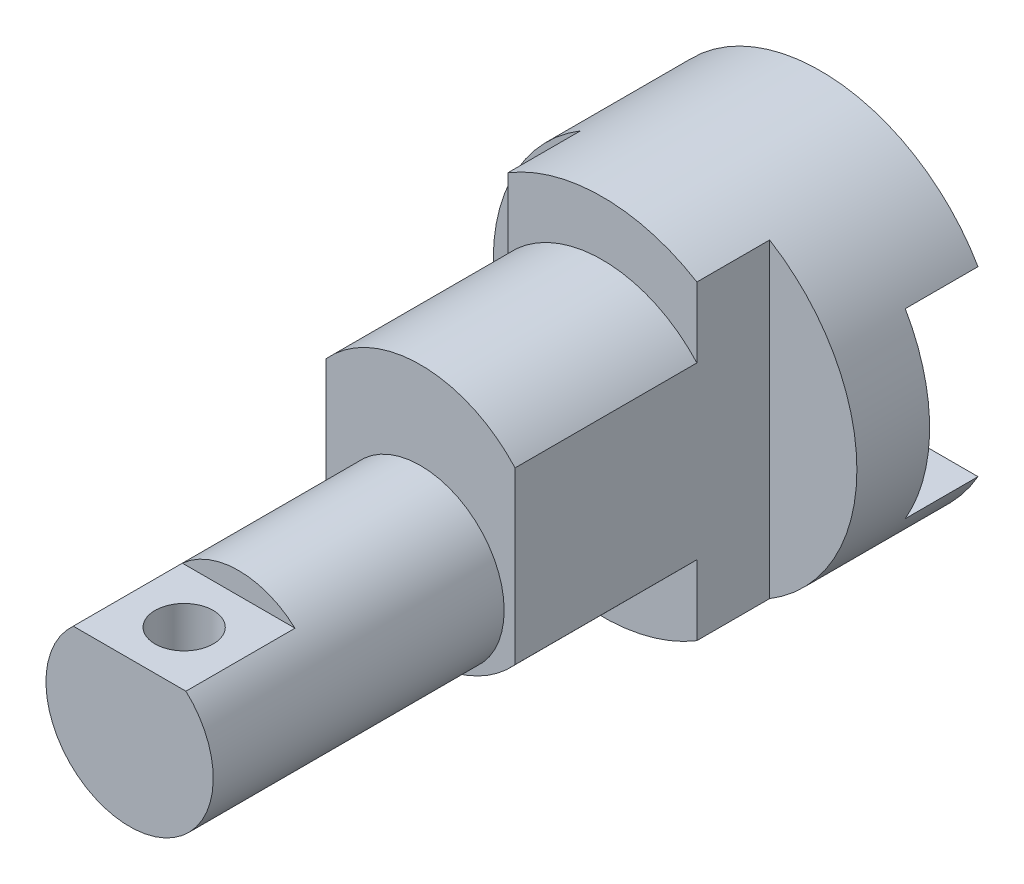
ISO-10303-21;
HEADER;
FILE_DESCRIPTION(('STEP AP214'),'2;1');
FILE_NAME('part.step','',(''),(''),'','','');
FILE_SCHEMA(('AUTOMOTIVE_DESIGN { 1 0 10303 214 1 1 1 1 }'));
ENDSEC;
DATA;
#1=APPLICATION_CONTEXT('core data for automotive mechanical design processes');
#2=APPLICATION_PROTOCOL_DEFINITION('international standard','automotive_design',2000,#1);
#3=PRODUCT_CONTEXT('',#1,'mechanical');
#4=PRODUCT('Part','Part','',(#3));
#5=PRODUCT_RELATED_PRODUCT_CATEGORY('part','',(#4));
#6=PRODUCT_DEFINITION_FORMATION('','',#4);
#7=PRODUCT_DEFINITION_CONTEXT('part definition',#1,'design');
#8=PRODUCT_DEFINITION('design','',#6,#7);
#9=PRODUCT_DEFINITION_SHAPE('','',#8);
#10=(LENGTH_UNIT() NAMED_UNIT(*) SI_UNIT(.MILLI.,.METRE.));
#11=(NAMED_UNIT(*) PLANE_ANGLE_UNIT() SI_UNIT($,.RADIAN.));
#12=(NAMED_UNIT(*) SI_UNIT($,.STERADIAN.) SOLID_ANGLE_UNIT());
#13=UNCERTAINTY_MEASURE_WITH_UNIT(LENGTH_MEASURE(1.E-05),#10,'distance_accuracy_value','');
#14=(GEOMETRIC_REPRESENTATION_CONTEXT(3) GLOBAL_UNCERTAINTY_ASSIGNED_CONTEXT((#13)) GLOBAL_UNIT_ASSIGNED_CONTEXT((#10,
#11,#12)) REPRESENTATION_CONTEXT('',''));
#15=CARTESIAN_POINT('',(0.,0.,0.));
#16=DIRECTION('',(0.,0.,1.));
#17=DIRECTION('',(1.,0.,0.));
#18=AXIS2_PLACEMENT_3D('',#15,#16,#17);
#19=CARTESIAN_POINT('',(0.,0.,0.));
#20=DIRECTION('',(0.,0.,1.));
#21=DIRECTION('',(1.,0.,0.));
#22=AXIS2_PLACEMENT_3D('',#19,#20,#21);
#23=PLANE('',#22);
#24=CARTESIAN_POINT('',(0.,0.,0.));
#25=DIRECTION('',(0.,0.,1.));
#26=DIRECTION('',(1.,0.,0.));
#27=AXIS2_PLACEMENT_3D('',#24,#25,#26);
#28=CIRCLE('',#27,50.);
#29=CARTESIAN_POINT('',(-43.3012701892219,-25.,0.));
#30=VERTEX_POINT('',#29);
#31=CARTESIAN_POINT('',(43.3012701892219,-25.,0.));
#32=VERTEX_POINT('',#31);
#33=EDGE_CURVE('E153',#30,#32,#28,.T.);
#34=ORIENTED_EDGE('',*,*,#33,.F.);
#35=DIRECTION('',(1.,0.,0.));
#36=VECTOR('',#35,1.);
#37=CARTESIAN_POINT('',(0.,-25.,0.));
#38=LINE('',#37,#36);
#39=EDGE_CURVE('E141',#30,#32,#38,.T.);
#40=ORIENTED_EDGE('',*,*,#39,.T.);
#41=EDGE_LOOP('',(#34,#40));
#42=FACE_BOUND('',#41,.T.);
#43=ADVANCED_FACE('F31',(#42),#23,.F.);
#44=CARTESIAN_POINT('',(0.,0.,60.));
#45=DIRECTION('',(0.,0.,1.));
#46=DIRECTION('',(1.,0.,0.));
#47=AXIS2_PLACEMENT_3D('',#44,#45,#46);
#48=PLANE('',#47);
#49=CARTESIAN_POINT('',(0.,0.,60.));
#50=DIRECTION('',(0.,0.,1.));
#51=DIRECTION('',(1.,0.,0.));
#52=AXIS2_PLACEMENT_3D('',#49,#50,#51);
#53=CIRCLE('',#52,50.);
#54=CARTESIAN_POINT('',(26.,42.7083130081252,60.));
#55=VERTEX_POINT('',#54);
#56=CARTESIAN_POINT('',(-26.,42.7083130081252,60.));
#57=VERTEX_POINT('',#56);
#58=EDGE_CURVE('E155',#55,#57,#53,.T.);
#59=ORIENTED_EDGE('',*,*,#58,.T.);
#60=DIRECTION('',(0.,-1.,0.));
#61=VECTOR('',#60,1.);
#62=CARTESIAN_POINT('',(-26.,0.,60.));
#63=LINE('',#62,#61);
#64=CARTESIAN_POINT('',(-26.,23.43074902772,60.));
#65=VERTEX_POINT('',#64);
#66=EDGE_CURVE('E203',#57,#65,#63,.T.);
#67=ORIENTED_EDGE('',*,*,#66,.T.);
#68=CARTESIAN_POINT('',(0.,0.,60.));
#69=DIRECTION('',(0.,0.,1.));
#70=DIRECTION('',(1.,0.,0.));
#71=AXIS2_PLACEMENT_3D('',#68,#69,#70);
#72=CIRCLE('',#71,35.);
#73=CARTESIAN_POINT('',(26.,23.43074902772,60.));
#74=VERTEX_POINT('',#73);
#75=EDGE_CURVE('E296',#74,#65,#72,.T.);
#76=ORIENTED_EDGE('',*,*,#75,.F.);
#77=DIRECTION('',(0.,1.,0.));
#78=VECTOR('',#77,1.);
#79=CARTESIAN_POINT('',(26.,0.,60.));
#80=LINE('',#79,#78);
#81=EDGE_CURVE('E220',#74,#55,#80,.T.);
#82=ORIENTED_EDGE('',*,*,#81,.T.);
#83=EDGE_LOOP('',(#59,#67,#76,#82));
#84=FACE_BOUND('',#83,.T.);
#85=ADVANCED_FACE('F264',(#84),#48,.T.);
#86=CARTESIAN_POINT('',(-26.,-23.43074902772,60.));
#87=VERTEX_POINT('',#86);
#88=CARTESIAN_POINT('',(26.,-23.43074902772,60.));
#89=VERTEX_POINT('',#88);
#90=EDGE_CURVE('E305',#87,#89,#72,.T.);
#91=ORIENTED_EDGE('',*,*,#90,.F.);
#92=CARTESIAN_POINT('',(-26.,-42.7083130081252,60.));
#93=VERTEX_POINT('',#92);
#94=EDGE_CURVE('E200',#87,#93,#63,.T.);
#95=ORIENTED_EDGE('',*,*,#94,.T.);
#96=CARTESIAN_POINT('',(26.,-42.7083130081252,60.));
#97=VERTEX_POINT('',#96);
#98=EDGE_CURVE('E152',#93,#97,#53,.T.);
#99=ORIENTED_EDGE('',*,*,#98,.T.);
#100=EDGE_CURVE('E223',#97,#89,#80,.T.);
#101=ORIENTED_EDGE('',*,*,#100,.T.);
#102=EDGE_LOOP('',(#91,#95,#99,#101));
#103=FACE_BOUND('',#102,.T.);
#104=ADVANCED_FACE('F268',(#103),#48,.T.);
#105=CARTESIAN_POINT('',(0.,0.,60.));
#106=DIRECTION('',(0.,0.,-1.));
#107=DIRECTION('',(-1.,0.,0.));
#108=AXIS2_PLACEMENT_3D('',#105,#106,#107);
#109=CYLINDRICAL_SURFACE('',#108,50.);
#110=ORIENTED_EDGE('',*,*,#33,.T.);
#111=DIRECTION('',(0.,0.,-1.));
#112=VECTOR('',#111,1.);
#113=CARTESIAN_POINT('',(43.3012701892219,-25.,60.));
#114=LINE('',#113,#112);
#115=CARTESIAN_POINT('',(43.3012701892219,-25.,20.));
#116=VERTEX_POINT('',#115);
#117=EDGE_CURVE('E149',#32,#116,#114,.F.);
#118=ORIENTED_EDGE('',*,*,#117,.T.);
#119=CARTESIAN_POINT('',(0.,0.,20.));
#120=DIRECTION('',(0.,0.,1.));
#121=DIRECTION('',(0.,-1.,0.));
#122=AXIS2_PLACEMENT_3D('',#119,#120,#121);
#123=CIRCLE('',#122,50.);
#124=CARTESIAN_POINT('',(43.3012701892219,25.,20.));
#125=VERTEX_POINT('',#124);
#126=EDGE_CURVE('E11',#116,#125,#123,.T.);
#127=ORIENTED_EDGE('',*,*,#126,.T.);
#128=DIRECTION('',(0.,0.,-1.));
#129=VECTOR('',#128,1.);
#130=CARTESIAN_POINT('',(43.3012701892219,25.,60.));
#131=LINE('',#130,#129);
#132=CARTESIAN_POINT('',(43.3012701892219,25.,0.));
#133=VERTEX_POINT('',#132);
#134=EDGE_CURVE('E136',#125,#133,#131,.T.);
#135=ORIENTED_EDGE('',*,*,#134,.T.);
#136=CARTESIAN_POINT('',(-43.3012701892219,25.,0.));
#137=VERTEX_POINT('',#136);
#138=EDGE_CURVE('E147',#133,#137,#28,.T.);
#139=ORIENTED_EDGE('',*,*,#138,.T.);
#140=DIRECTION('',(0.,0.,-1.));
#141=VECTOR('',#140,1.);
#142=CARTESIAN_POINT('',(-43.3012701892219,25.,60.));
#143=LINE('',#142,#141);
#144=CARTESIAN_POINT('',(-43.3012701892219,25.,20.));
#145=VERTEX_POINT('',#144);
#146=EDGE_CURVE('E46',#137,#145,#143,.F.);
#147=ORIENTED_EDGE('',*,*,#146,.T.);
#148=CARTESIAN_POINT('',(-43.3012701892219,-25.,20.));
#149=VERTEX_POINT('',#148);
#150=EDGE_CURVE('E35',#145,#149,#123,.T.);
#151=ORIENTED_EDGE('',*,*,#150,.T.);
#152=DIRECTION('',(0.,0.,-1.));
#153=VECTOR('',#152,1.);
#154=CARTESIAN_POINT('',(-43.3012701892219,-25.,60.));
#155=LINE('',#154,#153);
#156=EDGE_CURVE('E173',#149,#30,#155,.T.);
#157=ORIENTED_EDGE('',*,*,#156,.T.);
#158=EDGE_LOOP('',(#110,#118,#127,#135,#139,#147,#151,#157));
#159=FACE_BOUND('',#158,.T.);
#160=DIRECTION('',(0.,0.,-1.));
#161=VECTOR('',#160,1.);
#162=CARTESIAN_POINT('',(-26.,42.7083130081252,190.));
#163=LINE('',#162,#161);
#164=CARTESIAN_POINT('',(-26.,42.7083130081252,40.));
#165=VERTEX_POINT('',#164);
#166=EDGE_CURVE('E192',#57,#165,#163,.T.);
#167=ORIENTED_EDGE('',*,*,#166,.F.);
#168=ORIENTED_EDGE('',*,*,#58,.F.);
#169=DIRECTION('',(0.,0.,-1.));
#170=VECTOR('',#169,1.);
#171=CARTESIAN_POINT('',(26.,42.7083130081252,190.));
#172=LINE('',#171,#170);
#173=CARTESIAN_POINT('',(26.,42.7083130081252,40.));
#174=VERTEX_POINT('',#173);
#175=EDGE_CURVE('E212',#55,#174,#172,.T.);
#176=ORIENTED_EDGE('',*,*,#175,.T.);
#177=CARTESIAN_POINT('',(0.,0.,40.));
#178=DIRECTION('',(0.,0.,1.));
#179=DIRECTION('',(1.,0.,0.));
#180=AXIS2_PLACEMENT_3D('',#177,#178,#179);
#181=CIRCLE('',#180,50.);
#182=CARTESIAN_POINT('',(26.,-42.7083130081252,40.));
#183=VERTEX_POINT('',#182);
#184=EDGE_CURVE('E204',#183,#174,#181,.T.);
#185=ORIENTED_EDGE('',*,*,#184,.F.);
#186=DIRECTION('',(0.,0.,-1.));
#187=VECTOR('',#186,1.);
#188=CARTESIAN_POINT('',(26.,-42.7083130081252,190.));
#189=LINE('',#188,#187);
#190=EDGE_CURVE('E210',#97,#183,#189,.T.);
#191=ORIENTED_EDGE('',*,*,#190,.F.);
#192=ORIENTED_EDGE('',*,*,#98,.F.);
#193=DIRECTION('',(0.,0.,-1.));
#194=VECTOR('',#193,1.);
#195=CARTESIAN_POINT('',(-26.,-42.7083130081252,190.));
#196=LINE('',#195,#194);
#197=CARTESIAN_POINT('',(-26.,-42.7083130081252,40.));
#198=VERTEX_POINT('',#197);
#199=EDGE_CURVE('E194',#93,#198,#196,.T.);
#200=ORIENTED_EDGE('',*,*,#199,.T.);
#201=CARTESIAN_POINT('',(0.,0.,40.));
#202=DIRECTION('',(0.,0.,1.));
#203=DIRECTION('',(1.,0.,0.));
#204=AXIS2_PLACEMENT_3D('',#201,#202,#203);
#205=CIRCLE('',#204,50.);
#206=EDGE_CURVE('E186',#165,#198,#205,.T.);
#207=ORIENTED_EDGE('',*,*,#206,.F.);
#208=EDGE_LOOP('',(#167,#168,#176,#185,#191,#192,#200,#207));
#209=FACE_BOUND('',#208,.T.);
#210=ADVANCED_FACE('F33',(#159,#209),#109,.T.);
#211=CARTESIAN_POINT('',(0.,0.,110.));
#212=DIRECTION('',(0.,0.,-1.));
#213=DIRECTION('',(-1.,0.,0.));
#214=AXIS2_PLACEMENT_3D('',#211,#212,#213);
#215=CYLINDRICAL_SURFACE('',#214,35.);
#216=DIRECTION('',(0.,0.,-1.));
#217=VECTOR('',#216,1.);
#218=CARTESIAN_POINT('',(-26.,23.43074902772,110.));
#219=LINE('',#218,#217);
#220=CARTESIAN_POINT('',(-26.,23.43074902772,110.));
#221=VERTEX_POINT('',#220);
#222=EDGE_CURVE('E198',#221,#65,#219,.T.);
#223=ORIENTED_EDGE('',*,*,#222,.F.);
#224=CARTESIAN_POINT('',(0.,0.,110.));
#225=DIRECTION('',(0.,0.,1.));
#226=DIRECTION('',(1.,0.,0.));
#227=AXIS2_PLACEMENT_3D('',#224,#225,#226);
#228=CIRCLE('',#227,35.);
#229=CARTESIAN_POINT('',(26.,23.43074902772,110.));
#230=VERTEX_POINT('',#229);
#231=EDGE_CURVE('E294',#230,#221,#228,.T.);
#232=ORIENTED_EDGE('',*,*,#231,.F.);
#233=DIRECTION('',(0.,0.,-1.));
#234=VECTOR('',#233,1.);
#235=CARTESIAN_POINT('',(26.,23.43074902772,110.));
#236=LINE('',#235,#234);
#237=EDGE_CURVE('E215',#74,#230,#236,.F.);
#238=ORIENTED_EDGE('',*,*,#237,.F.);
#239=ORIENTED_EDGE('',*,*,#75,.T.);
#240=EDGE_LOOP('',(#223,#232,#238,#239));
#241=FACE_BOUND('',#240,.T.);
#242=ADVANCED_FACE('F281',(#241),#215,.T.);
#243=DIRECTION('',(0.,0.,-1.));
#244=VECTOR('',#243,1.);
#245=CARTESIAN_POINT('',(-26.,-23.43074902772,110.));
#246=LINE('',#245,#244);
#247=CARTESIAN_POINT('',(-26.,-23.43074902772,110.));
#248=VERTEX_POINT('',#247);
#249=EDGE_CURVE('E54',#87,#248,#246,.F.);
#250=ORIENTED_EDGE('',*,*,#249,.F.);
#251=ORIENTED_EDGE('',*,*,#90,.T.);
#252=DIRECTION('',(0.,0.,-1.));
#253=VECTOR('',#252,1.);
#254=CARTESIAN_POINT('',(26.,-23.43074902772,110.));
#255=LINE('',#254,#253);
#256=CARTESIAN_POINT('',(26.,-23.43074902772,110.));
#257=VERTEX_POINT('',#256);
#258=EDGE_CURVE('E217',#257,#89,#255,.T.);
#259=ORIENTED_EDGE('',*,*,#258,.F.);
#260=CARTESIAN_POINT('',(0.,-35.,110.));
#261=VERTEX_POINT('',#260);
#262=EDGE_CURVE('E157',#261,#257,#228,.T.);
#263=ORIENTED_EDGE('',*,*,#262,.F.);
#264=EDGE_CURVE('E300',#248,#261,#228,.T.);
#265=ORIENTED_EDGE('',*,*,#264,.F.);
#266=EDGE_LOOP('',(#250,#251,#259,#263,#265));
#267=FACE_BOUND('',#266,.T.);
#268=ADVANCED_FACE('F276',(#267),#215,.T.);
#269=CARTESIAN_POINT('',(0.,0.,110.));
#270=DIRECTION('',(0.,0.,1.));
#271=DIRECTION('',(1.,0.,0.));
#272=AXIS2_PLACEMENT_3D('',#269,#270,#271);
#273=PLANE('',#272);
#274=ORIENTED_EDGE('',*,*,#231,.T.);
#275=DIRECTION('',(0.,-1.,0.));
#276=VECTOR('',#275,1.);
#277=CARTESIAN_POINT('',(-26.,0.,110.));
#278=LINE('',#277,#276);
#279=EDGE_CURVE('E142',#221,#248,#278,.T.);
#280=ORIENTED_EDGE('',*,*,#279,.T.);
#281=ORIENTED_EDGE('',*,*,#264,.T.);
#282=CARTESIAN_POINT('',(0.,-12.,110.));
#283=DIRECTION('',(0.,0.,1.));
#284=DIRECTION('',(1.,0.,0.));
#285=AXIS2_PLACEMENT_3D('',#282,#283,#284);
#286=CIRCLE('',#285,23.);
#287=EDGE_CURVE('E303',#261,#261,#286,.T.);
#288=ORIENTED_EDGE('',*,*,#287,.F.);
#289=ORIENTED_EDGE('',*,*,#262,.T.);
#290=DIRECTION('',(0.,1.,0.));
#291=VECTOR('',#290,1.);
#292=CARTESIAN_POINT('',(26.,0.,110.));
#293=LINE('',#292,#291);
#294=EDGE_CURVE('E165',#257,#230,#293,.T.);
#295=ORIENTED_EDGE('',*,*,#294,.T.);
#296=EDGE_LOOP('',(#274,#280,#281,#288,#289,#295));
#297=FACE_BOUND('',#296,.T.);
#298=ADVANCED_FACE('F272',(#297),#273,.T.);
#299=ORIENTED_EDGE('',*,*,#138,.F.);
#300=DIRECTION('',(-1.,0.,0.));
#301=VECTOR('',#300,1.);
#302=CARTESIAN_POINT('',(0.,25.,0.));
#303=LINE('',#302,#301);
#304=EDGE_CURVE('E133',#133,#137,#303,.T.);
#305=ORIENTED_EDGE('',*,*,#304,.T.);
#306=EDGE_LOOP('',(#299,#305));
#307=FACE_BOUND('',#306,.T.);
#308=ADVANCED_FACE('F151',(#307),#23,.F.);
#309=CARTESIAN_POINT('',(0.,-12.,190.));
#310=DIRECTION('',(0.,0.,-1.));
#311=DIRECTION('',(-1.,0.,0.));
#312=AXIS2_PLACEMENT_3D('',#309,#310,#311);
#313=CYLINDRICAL_SURFACE('',#312,23.);
#314=CARTESIAN_POINT('',(0.,-35.,183.));
#315=CARTESIAN_POINT('',(0.217698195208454,-35.0000002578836,183.000000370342));
#316=CARTESIAN_POINT('',(0.435390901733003,-34.9969022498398,182.991106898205));
#317=CARTESIAN_POINT('',(0.86915745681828,-34.9845956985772,182.955621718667));
#318=CARTESIAN_POINT('',(1.08523129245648,-34.9753871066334,182.929029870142));
#319=CARTESIAN_POINT('',(1.51416564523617,-34.9511099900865,182.858406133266));
#320=CARTESIAN_POINT('',(1.72702623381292,-34.9360415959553,182.814374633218));
#321=CARTESIAN_POINT('',(2.14803250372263,-34.9004495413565,182.709282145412));
#322=CARTESIAN_POINT('',(2.35617812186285,-34.8799258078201,182.648220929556));
#323=CARTESIAN_POINT('',(2.76593194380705,-34.8340106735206,182.509746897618));
#324=CARTESIAN_POINT('',(2.96755229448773,-34.8086290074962,182.432366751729));
#325=CARTESIAN_POINT('',(3.36346343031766,-34.7536167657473,182.261789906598));
#326=CARTESIAN_POINT('',(3.55775164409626,-34.7239847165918,182.168587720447));
#327=CARTESIAN_POINT('',(3.93771098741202,-34.6612335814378,181.967113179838));
#328=CARTESIAN_POINT('',(4.12338360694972,-34.6281151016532,181.858843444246));
#329=CARTESIAN_POINT('',(4.48513691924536,-34.5591992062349,181.627941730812));
#330=CARTESIAN_POINT('',(4.66121412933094,-34.5234008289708,181.505304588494));
#331=CARTESIAN_POINT('',(5.00844074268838,-34.4487884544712,181.242158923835));
#332=CARTESIAN_POINT('',(5.17922802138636,-34.4099136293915,181.101189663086));
#333=CARTESIAN_POINT('',(5.50842805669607,-34.3312755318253,180.805699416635));
#334=CARTESIAN_POINT('',(5.66684050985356,-34.2915122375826,180.651178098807));
#335=CARTESIAN_POINT('',(5.97040912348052,-34.2121327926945,180.32946036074));
#336=CARTESIAN_POINT('',(6.11555984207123,-34.1725167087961,180.162258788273));
#337=CARTESIAN_POINT('',(6.39158536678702,-34.0945288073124,179.816284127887));
#338=CARTESIAN_POINT('',(6.52246502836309,-34.0561565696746,179.637515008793));
#339=CARTESIAN_POINT('',(6.77312918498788,-33.9805007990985,179.26345265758));
#340=CARTESIAN_POINT('',(6.89241910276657,-33.9432924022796,179.067812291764));
#341=CARTESIAN_POINT('',(7.1139711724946,-33.8724699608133,178.666593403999));
#342=CARTESIAN_POINT('',(7.21624008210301,-33.8388544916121,178.461018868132));
#343=CARTESIAN_POINT('',(7.40294407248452,-33.776274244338,178.041246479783));
#344=CARTESIAN_POINT('',(7.48738005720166,-33.7473092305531,177.827049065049));
#345=CARTESIAN_POINT('',(7.63763783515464,-33.6949954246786,177.3915555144));
#346=CARTESIAN_POINT('',(7.70346054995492,-33.6716463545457,177.170259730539));
#347=CARTESIAN_POINT('',(7.81379278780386,-33.632104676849,176.73037082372));
#348=CARTESIAN_POINT('',(7.85898802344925,-33.6156834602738,176.511970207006));
#349=CARTESIAN_POINT('',(7.93101771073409,-33.5893592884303,176.071771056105));
#350=CARTESIAN_POINT('',(7.95785257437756,-33.5794561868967,175.849972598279));
#351=CARTESIAN_POINT('',(7.99287190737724,-33.5665098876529,175.404773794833));
#352=CARTESIAN_POINT('',(8.00106188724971,-33.5634646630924,175.181373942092));
#353=CARTESIAN_POINT('',(7.99871794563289,-33.5643343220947,174.73468977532));
#354=CARTESIAN_POINT('',(7.98818461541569,-33.568248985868,174.511405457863));
#355=CARTESIAN_POINT('',(7.94951648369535,-33.5825295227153,174.077988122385));
#356=CARTESIAN_POINT('',(7.92229929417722,-33.5925589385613,173.867761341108));
#357=CARTESIAN_POINT('',(7.8513423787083,-33.6184608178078,173.450405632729));
#358=CARTESIAN_POINT('',(7.80759684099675,-33.6343353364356,173.243277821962));
#359=CARTESIAN_POINT('',(7.70399611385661,-33.6714435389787,172.833651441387));
#360=CARTESIAN_POINT('',(7.64414546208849,-33.692675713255,172.631151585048));
#361=CARTESIAN_POINT('',(7.50881216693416,-33.7398912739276,172.231935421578));
#362=CARTESIAN_POINT('',(7.43332357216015,-33.7658764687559,172.035221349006));
#363=CARTESIAN_POINT('',(7.26592988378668,-33.8223323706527,171.64560463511));
#364=CARTESIAN_POINT('',(7.17377130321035,-33.852870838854,171.452820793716));
#365=CARTESIAN_POINT('',(6.97456977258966,-33.9172610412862,171.075603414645));
#366=CARTESIAN_POINT('',(6.86752174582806,-33.9511139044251,170.891172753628));
#367=CARTESIAN_POINT('',(6.63927955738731,-34.0212219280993,170.531746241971));
#368=CARTESIAN_POINT('',(6.5180842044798,-34.0574772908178,170.356751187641));
#369=CARTESIAN_POINT('',(6.26230747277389,-34.1314533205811,170.01715985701));
#370=CARTESIAN_POINT('',(6.12772557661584,-34.1691740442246,169.852563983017));
#371=CARTESIAN_POINT('',(5.8378650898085,-34.2473173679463,169.52553466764));
#372=CARTESIAN_POINT('',(5.68184189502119,-34.2877707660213,169.363767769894));
#373=CARTESIAN_POINT('',(5.35672473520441,-34.3681364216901,169.053916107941));
#374=CARTESIAN_POINT('',(5.18763485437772,-34.4080488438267,168.905827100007));
#375=CARTESIAN_POINT('',(4.83727787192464,-34.4862840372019,168.624163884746));
#376=CARTESIAN_POINT('',(4.65600480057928,-34.5246060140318,168.490596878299));
#377=CARTESIAN_POINT('',(4.28254040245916,-34.5985854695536,168.239044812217));
#378=CARTESIAN_POINT('',(4.09035345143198,-34.6342440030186,168.121053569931));
#379=CARTESIAN_POINT('',(3.69381401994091,-34.7023498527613,167.900150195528));
#380=CARTESIAN_POINT('',(3.48934229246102,-34.7347529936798,167.797438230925));
#381=CARTESIAN_POINT('',(3.07185991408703,-34.7949145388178,167.609733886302));
#382=CARTESIAN_POINT('',(2.85885285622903,-34.8226748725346,167.524734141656));
#383=CARTESIAN_POINT('',(2.42576745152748,-34.8727602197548,167.373186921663));
#384=CARTESIAN_POINT('',(2.20568976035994,-34.8950857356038,167.306637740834));
#385=CARTESIAN_POINT('',(1.76012060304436,-34.9336426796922,167.192641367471));
#386=CARTESIAN_POINT('',(1.53462941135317,-34.9498744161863,167.1451932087));
#387=CARTESIAN_POINT('',(1.09065621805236,-34.9751513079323,167.071651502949));
#388=CARTESIAN_POINT('',(0.872339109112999,-34.9844968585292,167.044663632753));
#389=CARTESIAN_POINT('',(0.434048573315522,-34.9969488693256,167.008758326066));
#390=CARTESIAN_POINT('',(0.214075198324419,-35.0000555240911,166.999840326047));
#391=CARTESIAN_POINT('',(-0.225818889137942,-34.9999429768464,167.000163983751));
#392=CARTESIAN_POINT('',(-0.445739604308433,-34.996724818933,167.009402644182));
#393=CARTESIAN_POINT('',(-0.88389184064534,-34.984054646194,167.045940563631));
#394=CARTESIAN_POINT('',(-1.10212338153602,-34.9746027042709,167.073239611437));
#395=CARTESIAN_POINT('',(-1.52826007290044,-34.9501306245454,167.144455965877));
#396=CARTESIAN_POINT('',(-1.73627102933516,-34.9353002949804,167.187807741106));
#397=CARTESIAN_POINT('',(-2.14784935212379,-34.9004238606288,167.29080028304));
#398=CARTESIAN_POINT('',(-2.35141511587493,-34.8803759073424,167.350446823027));
#399=CARTESIAN_POINT('',(-2.7526473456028,-34.8355791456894,167.485498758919));
#400=CARTESIAN_POINT('',(-2.95031544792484,-34.8108316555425,167.560899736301));
#401=CARTESIAN_POINT('',(-3.33866711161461,-34.7572349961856,167.726904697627));
#402=CARTESIAN_POINT('',(-3.52934799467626,-34.7283842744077,167.817514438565));
#403=CARTESIAN_POINT('',(-3.90759978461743,-34.6664594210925,168.015910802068));
#404=CARTESIAN_POINT('',(-4.09494590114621,-34.6332919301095,168.124096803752));
#405=CARTESIAN_POINT('',(-4.45997092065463,-34.5642013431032,168.355052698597));
#406=CARTESIAN_POINT('',(-4.63764646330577,-34.5282772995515,168.477827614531));
#407=CARTESIAN_POINT('',(-4.98227552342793,-34.4545761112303,168.737138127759));
#408=CARTESIAN_POINT('',(-5.14922780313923,-34.4167987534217,168.87367530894));
#409=CARTESIAN_POINT('',(-5.47145884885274,-34.34033492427,169.15966203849));
#410=CARTESIAN_POINT('',(-5.62673726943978,-34.3016484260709,169.30911196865));
#411=CARTESIAN_POINT('',(-5.93218856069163,-34.2224045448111,169.627825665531));
#412=CARTESIAN_POINT('',(-6.08171950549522,-34.181850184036,169.797706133));
#413=CARTESIAN_POINT('',(-6.36593382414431,-34.1019609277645,170.149636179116));
#414=CARTESIAN_POINT('',(-6.50062205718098,-34.0626256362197,170.331681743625));
#415=CARTESIAN_POINT('',(-6.75434313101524,-33.9862778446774,170.706962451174));
#416=CARTESIAN_POINT('',(-6.87336901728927,-33.9492663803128,170.900202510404));
#417=CARTESIAN_POINT('',(-7.09475961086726,-33.878708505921,171.296504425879));
#418=CARTESIAN_POINT('',(-7.19713128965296,-33.8451606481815,171.499562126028));
#419=CARTESIAN_POINT('',(-7.38445275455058,-33.7825530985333,171.91428522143));
#420=CARTESIAN_POINT('',(-7.46939909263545,-33.7534942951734,172.12595231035));
#421=CARTESIAN_POINT('',(-7.62104488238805,-33.7008323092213,172.556294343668));
#422=CARTESIAN_POINT('',(-7.68775180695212,-33.6772268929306,172.774966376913));
#423=CARTESIAN_POINT('',(-7.80229339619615,-33.6362640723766,173.217727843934));
#424=CARTESIAN_POINT('',(-7.85013212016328,-33.6189053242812,173.441816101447));
#425=CARTESIAN_POINT('',(-7.92644665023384,-33.5910421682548,173.893683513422));
#426=CARTESIAN_POINT('',(-7.95492355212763,-33.5805373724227,174.12146245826));
#427=CARTESIAN_POINT('',(-7.99115967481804,-33.5671442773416,174.566061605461));
#428=CARTESIAN_POINT('',(-7.9999868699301,-33.563863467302,174.782783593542));
#429=CARTESIAN_POINT('',(-8.00001309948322,-33.5638538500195,175.216226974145));
#430=CARTESIAN_POINT('',(-7.99121257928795,-33.5671248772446,175.432948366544));
#431=CARTESIAN_POINT('',(-7.95607500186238,-33.5801116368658,175.864749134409));
#432=CARTESIAN_POINT('',(-7.92973931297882,-33.5898268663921,176.079828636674));
#433=CARTESIAN_POINT('',(-7.85979573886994,-33.6153878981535,176.506787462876));
#434=CARTESIAN_POINT('',(-7.81618781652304,-33.6312337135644,176.718666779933));
#435=CARTESIAN_POINT('',(-7.71330254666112,-33.6681303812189,177.132950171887));
#436=CARTESIAN_POINT('',(-7.65440503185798,-33.6890543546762,177.335460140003));
#437=CARTESIAN_POINT('',(-7.52099476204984,-33.735676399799,177.734770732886));
#438=CARTESIAN_POINT('',(-7.44647681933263,-33.761376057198,177.931569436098));
#439=CARTESIAN_POINT('',(-7.28242755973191,-33.816822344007,178.318180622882));
#440=CARTESIAN_POINT('',(-7.19289886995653,-33.8465682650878,178.507994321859));
#441=CARTESIAN_POINT('',(-6.99946285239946,-33.9093098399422,178.879621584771));
#442=CARTESIAN_POINT('',(-6.89554996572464,-33.9423067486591,179.061432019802));
#443=CARTESIAN_POINT('',(-6.55296253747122,-34.0480736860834,179.609750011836));
#444=CARTESIAN_POINT('',(-6.29099070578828,-34.1249458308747,179.961259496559));
#445=CARTESIAN_POINT('',(-5.7135032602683,-34.2810461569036,180.616647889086));
#446=CARTESIAN_POINT('',(-5.39797187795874,-34.3602750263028,180.920512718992));
#447=CARTESIAN_POINT('',(-4.88291098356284,-34.4764355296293,181.341084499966));
#448=CARTESIAN_POINT('',(-4.69993365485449,-34.515499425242,181.477876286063));
#449=CARTESIAN_POINT('',(-4.32260206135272,-34.5909729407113,181.735520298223));
#450=CARTESIAN_POINT('',(-4.12825214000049,-34.6273835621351,181.85637855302));
#451=CARTESIAN_POINT('',(-3.72935374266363,-34.6965398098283,182.081269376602));
#452=CARTESIAN_POINT('',(-3.52480211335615,-34.729284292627,182.18529670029));
#453=CARTESIAN_POINT('',(-3.10702550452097,-34.7901496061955,182.375570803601));
#454=CARTESIAN_POINT('',(-2.8938043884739,-34.8182724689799,182.461825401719));
#455=CARTESIAN_POINT('',(-2.46342392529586,-34.8687072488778,182.61465020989));
#456=CARTESIAN_POINT('',(-2.24637285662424,-34.8911005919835,182.681498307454));
#457=CARTESIAN_POINT('',(-1.80686859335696,-34.9299778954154,182.796590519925));
#458=CARTESIAN_POINT('',(-1.5844154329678,-34.9464618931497,182.844834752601));
#459=CARTESIAN_POINT('',(-1.13589564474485,-34.9730318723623,182.92221657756));
#460=CARTESIAN_POINT('',(-0.909830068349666,-34.9831196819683,182.951359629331));
#461=CARTESIAN_POINT('',(-0.455840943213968,-34.9966034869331,182.990250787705));
#462=CARTESIAN_POINT('',(-0.22791746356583,-34.9999997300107,182.999999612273));
#463=CARTESIAN_POINT('',(0.,-35.,183.));
#464=B_SPLINE_CURVE_WITH_KNOTS('',3,(#314,#315,#316,#317,#318,#319,#320,#321,#322,#323,#324,
#325,#326,#327,#328,#329,#330,#331,#332,#333,#334,#335,#336,#337,#338,#339,#340,#341,#342,#343,
#344,#345,#346,#347,#348,#349,#350,#351,#352,#353,#354,#355,#356,#357,#358,#359,#360,#361,#362,
#363,#364,#365,#366,#367,#368,#369,#370,#371,#372,#373,#374,#375,#376,#377,#378,#379,#380,#381,
#382,#383,#384,#385,#386,#387,#388,#389,#390,#391,#392,#393,#394,#395,#396,#397,#398,#399,#400,
#401,#402,#403,#404,#405,#406,#407,#408,#409,#410,#411,#412,#413,#414,#415,#416,#417,#418,#419,
#420,#421,#422,#423,#424,#425,#426,#427,#428,#429,#430,#431,#432,#433,#434,#435,#436,#437,#438,
#439,#440,#441,#442,#443,#444,#445,#446,#447,#448,#449,#450,#451,#452,#453,#454,#455,#456,#457,
#458,#459,#460,#461,#462,#463),.UNSPECIFIED.,.T.,.F.,(4,2,2,2,2,2,2,2,2,2,2,2,2,2,2,2,2,2,2,2,2,
2,2,2,2,2,2,2,2,2,2,2,2,2,2,2,2,2,2,2,2,2,2,2,2,2,2,2,2,2,2,2,2,2,2,2,2,2,2,2,2,2,2,2,2,2,2,2,2,
2,2,2,2,2,4),(0.,0.652882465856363,1.30577013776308,1.95864327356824,2.61152515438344,
3.26311217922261,3.91492563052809,4.56662593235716,5.21856121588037,5.89231451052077,
6.56608432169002,7.24012938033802,7.91394438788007,8.60951182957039,9.30480245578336,
10.0000578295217,10.6952787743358,11.3653145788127,12.0353353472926,12.7051580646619,
13.3749596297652,14.0108689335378,14.647002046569,15.2829561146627,15.9191526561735,
16.5659912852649,17.2130510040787,17.8601652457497,18.5073045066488,19.1915931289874,
19.8756687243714,20.5600819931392,21.2442227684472,21.9366582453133,22.6288052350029,
23.3208882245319,24.0129362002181,24.6726433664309,25.3323299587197,25.9919076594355,
26.6514776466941,27.2897334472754,27.9282156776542,28.5665190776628,29.2050646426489,
29.8609372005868,30.5170362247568,31.1732108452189,31.8294048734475,32.5183593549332,
33.2070876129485,33.8961206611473,34.5848645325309,35.2737445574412,35.9623419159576,
36.6507910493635,37.3392012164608,37.9891747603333,38.6391318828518,39.2890382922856,
39.9389460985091,40.5740396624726,41.2093444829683,41.8445382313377,42.4799781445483,
43.8089739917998,45.1383617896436,45.8329672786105,46.5273091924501,47.221867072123,
47.9161187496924,48.5998742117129,49.2836253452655,49.9671809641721,50.6507112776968),.UNSPECIFIED.);
#465=CARTESIAN_POINT('',(0.,-35.,183.));
#466=VERTEX_POINT('',#465);
#467=EDGE_CURVE('E227',#466,#466,#464,.T.);
#468=ORIENTED_EDGE('',*,*,#467,.T.);
#469=EDGE_LOOP('',(#468));
#470=FACE_BOUND('',#469,.T.);
#471=CARTESIAN_POINT('',(0.,-12.,190.));
#472=DIRECTION('',(0.,0.,1.));
#473=DIRECTION('',(1.,0.,0.));
#474=AXIS2_PLACEMENT_3D('',#471,#472,#473);
#475=CIRCLE('',#474,23.);
#476=CARTESIAN_POINT('',(-15.4919333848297,5.,190.));
#477=VERTEX_POINT('',#476);
#478=CARTESIAN_POINT('',(15.4919333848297,5.,190.));
#479=VERTEX_POINT('',#478);
#480=EDGE_CURVE('E306',#477,#479,#475,.T.);
#481=ORIENTED_EDGE('',*,*,#480,.F.);
#482=DIRECTION('',(0.,0.,-1.));
#483=VECTOR('',#482,1.);
#484=CARTESIAN_POINT('',(-15.4919333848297,5.,190.));
#485=LINE('',#484,#483);
#486=CARTESIAN_POINT('',(-15.4919333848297,5.,160.));
#487=VERTEX_POINT('',#486);
#488=EDGE_CURVE('E312',#477,#487,#485,.T.);
#489=ORIENTED_EDGE('',*,*,#488,.T.);
#490=CARTESIAN_POINT('',(0.,-12.,160.));
#491=DIRECTION('',(0.,0.,-1.));
#492=DIRECTION('',(-1.,0.,0.));
#493=AXIS2_PLACEMENT_3D('',#490,#491,#492);
#494=CIRCLE('',#493,23.);
#495=CARTESIAN_POINT('',(15.4919333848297,5.,160.));
#496=VERTEX_POINT('',#495);
#497=EDGE_CURVE('E162',#487,#496,#494,.T.);
#498=ORIENTED_EDGE('',*,*,#497,.T.);
#499=DIRECTION('',(0.,0.,-1.));
#500=VECTOR('',#499,1.);
#501=CARTESIAN_POINT('',(15.4919333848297,5.,190.));
#502=LINE('',#501,#500);
#503=EDGE_CURVE('E315',#496,#479,#502,.F.);
#504=ORIENTED_EDGE('',*,*,#503,.T.);
#505=EDGE_LOOP('',(#481,#489,#498,#504));
#506=FACE_BOUND('',#505,.T.);
#507=ORIENTED_EDGE('',*,*,#287,.T.);
#508=EDGE_LOOP('',(#507));
#509=FACE_BOUND('',#508,.T.);
#510=ADVANCED_FACE('F236',(#470,#506,#509),#313,.T.);
#511=CARTESIAN_POINT('',(0.,-12.,190.));
#512=DIRECTION('',(0.,0.,1.));
#513=DIRECTION('',(1.,0.,0.));
#514=AXIS2_PLACEMENT_3D('',#511,#512,#513);
#515=PLANE('',#514);
#516=DIRECTION('',(1.,0.,0.));
#517=VECTOR('',#516,1.);
#518=CARTESIAN_POINT('',(0.,5.,190.));
#519=LINE('',#518,#517);
#520=EDGE_CURVE('E160',#477,#479,#519,.T.);
#521=ORIENTED_EDGE('',*,*,#520,.F.);
#522=ORIENTED_EDGE('',*,*,#480,.T.);
#523=EDGE_LOOP('',(#521,#522));
#524=FACE_BOUND('',#523,.T.);
#525=ADVANCED_FACE('F254',(#524),#515,.T.);
#526=CARTESIAN_POINT('',(-20.,5.,160.));
#527=DIRECTION('',(0.,0.,-1.));
#528=DIRECTION('',(-1.,0.,0.));
#529=AXIS2_PLACEMENT_3D('',#526,#527,#528);
#530=PLANE('',#529);
#531=DIRECTION('',(-1.,0.,0.));
#532=VECTOR('',#531,1.);
#533=CARTESIAN_POINT('',(-20.,5.,160.));
#534=LINE('',#533,#532);
#535=EDGE_CURVE('E234',#496,#487,#534,.T.);
#536=ORIENTED_EDGE('',*,*,#535,.F.);
#537=ORIENTED_EDGE('',*,*,#497,.F.);
#538=EDGE_LOOP('',(#536,#537));
#539=FACE_BOUND('',#538,.T.);
#540=ADVANCED_FACE('F251',(#539),#530,.F.);
#541=CARTESIAN_POINT('',(-20.,5.,190.));
#542=DIRECTION('',(0.,-1.,0.));
#543=DIRECTION('',(0.,0.,-1.));
#544=AXIS2_PLACEMENT_3D('',#541,#542,#543);
#545=PLANE('',#544);
#546=CARTESIAN_POINT('',(0.,5.,175.));
#547=DIRECTION('',(0.,1.,0.));
#548=DIRECTION('',(0.,0.,1.));
#549=AXIS2_PLACEMENT_3D('',#546,#547,#548);
#550=CIRCLE('',#549,8.);
#551=CARTESIAN_POINT('',(0.,5.,183.));
#552=VERTEX_POINT('',#551);
#553=EDGE_CURVE('E224',#552,#552,#550,.T.);
#554=ORIENTED_EDGE('',*,*,#553,.F.);
#555=EDGE_LOOP('',(#554));
#556=FACE_BOUND('',#555,.T.);
#557=ORIENTED_EDGE('',*,*,#520,.T.);
#558=ORIENTED_EDGE('',*,*,#503,.F.);
#559=ORIENTED_EDGE('',*,*,#535,.T.);
#560=ORIENTED_EDGE('',*,*,#488,.F.);
#561=EDGE_LOOP('',(#557,#558,#559,#560));
#562=FACE_BOUND('',#561,.T.);
#563=ADVANCED_FACE('F246',(#556,#562),#545,.F.);
#564=CARTESIAN_POINT('',(0.,-50.,175.));
#565=DIRECTION('',(0.,1.,0.));
#566=DIRECTION('',(0.,0.,1.));
#567=AXIS2_PLACEMENT_3D('',#564,#565,#566);
#568=CYLINDRICAL_SURFACE('',#567,8.);
#569=ORIENTED_EDGE('',*,*,#553,.T.);
#570=EDGE_LOOP('',(#569));
#571=FACE_BOUND('',#570,.T.);
#572=ORIENTED_EDGE('',*,*,#467,.F.);
#573=EDGE_LOOP('',(#572));
#574=FACE_BOUND('',#573,.T.);
#575=ADVANCED_FACE('F240',(#571,#574),#568,.F.);
#576=CARTESIAN_POINT('',(26.,-42.7083130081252,190.));
#577=DIRECTION('',(1.,0.,0.));
#578=DIRECTION('',(0.,0.,-1.));
#579=AXIS2_PLACEMENT_3D('',#576,#577,#578);
#580=PLANE('',#579);
#581=ORIENTED_EDGE('',*,*,#190,.T.);
#582=DIRECTION('',(0.,-1.,0.));
#583=VECTOR('',#582,1.);
#584=CARTESIAN_POINT('',(26.,-42.7083130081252,40.));
#585=LINE('',#584,#583);
#586=EDGE_CURVE('E207',#174,#183,#585,.T.);
#587=ORIENTED_EDGE('',*,*,#586,.F.);
#588=ORIENTED_EDGE('',*,*,#175,.F.);
#589=ORIENTED_EDGE('',*,*,#81,.F.);
#590=ORIENTED_EDGE('',*,*,#237,.T.);
#591=ORIENTED_EDGE('',*,*,#294,.F.);
#592=ORIENTED_EDGE('',*,*,#258,.T.);
#593=ORIENTED_EDGE('',*,*,#100,.F.);
#594=EDGE_LOOP('',(#581,#587,#588,#589,#590,#591,#592,#593));
#595=FACE_BOUND('',#594,.T.);
#596=ADVANCED_FACE('F245',(#595),#580,.T.);
#597=CARTESIAN_POINT('',(0.,0.,40.));
#598=DIRECTION('',(0.,0.,1.));
#599=DIRECTION('',(1.,0.,0.));
#600=AXIS2_PLACEMENT_3D('',#597,#598,#599);
#601=PLANE('',#600);
#602=ORIENTED_EDGE('',*,*,#184,.T.);
#603=ORIENTED_EDGE('',*,*,#586,.T.);
#604=EDGE_LOOP('',(#602,#603));
#605=FACE_BOUND('',#604,.T.);
#606=ADVANCED_FACE('F334',(#605),#601,.T.);
#607=CARTESIAN_POINT('',(-26.,42.7083130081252,190.));
#608=DIRECTION('',(-1.,0.,0.));
#609=DIRECTION('',(0.,0.,1.));
#610=AXIS2_PLACEMENT_3D('',#607,#608,#609);
#611=PLANE('',#610);
#612=ORIENTED_EDGE('',*,*,#166,.T.);
#613=DIRECTION('',(0.,1.,0.));
#614=VECTOR('',#613,1.);
#615=CARTESIAN_POINT('',(-26.,42.7083130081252,40.));
#616=LINE('',#615,#614);
#617=EDGE_CURVE('E189',#198,#165,#616,.T.);
#618=ORIENTED_EDGE('',*,*,#617,.F.);
#619=ORIENTED_EDGE('',*,*,#199,.F.);
#620=ORIENTED_EDGE('',*,*,#94,.F.);
#621=ORIENTED_EDGE('',*,*,#249,.T.);
#622=ORIENTED_EDGE('',*,*,#279,.F.);
#623=ORIENTED_EDGE('',*,*,#222,.T.);
#624=ORIENTED_EDGE('',*,*,#66,.F.);
#625=EDGE_LOOP('',(#612,#618,#619,#620,#621,#622,#623,#624));
#626=FACE_BOUND('',#625,.T.);
#627=ADVANCED_FACE('F337',(#626),#611,.T.);
#628=CARTESIAN_POINT('',(0.,0.,40.));
#629=DIRECTION('',(0.,0.,1.));
#630=DIRECTION('',(1.,0.,0.));
#631=AXIS2_PLACEMENT_3D('',#628,#629,#630);
#632=PLANE('',#631);
#633=ORIENTED_EDGE('',*,*,#206,.T.);
#634=ORIENTED_EDGE('',*,*,#617,.T.);
#635=EDGE_LOOP('',(#633,#634));
#636=FACE_BOUND('',#635,.T.);
#637=ADVANCED_FACE('F339',(#636),#632,.T.);
#638=CARTESIAN_POINT('',(-60.,25.,20.));
#639=DIRECTION('',(0.,0.,1.));
#640=DIRECTION('',(0.,-1.,0.));
#641=AXIS2_PLACEMENT_3D('',#638,#639,#640);
#642=PLANE('',#641);
#643=DIRECTION('',(1.,0.,0.));
#644=VECTOR('',#643,1.);
#645=CARTESIAN_POINT('',(-60.,-25.,20.));
#646=LINE('',#645,#644);
#647=EDGE_CURVE('E179',#149,#116,#646,.T.);
#648=ORIENTED_EDGE('',*,*,#647,.F.);
#649=ORIENTED_EDGE('',*,*,#150,.F.);
#650=DIRECTION('',(1.,0.,0.));
#651=VECTOR('',#650,1.);
#652=CARTESIAN_POINT('',(-60.,25.,20.));
#653=LINE('',#652,#651);
#654=EDGE_CURVE('E177',#145,#125,#653,.T.);
#655=ORIENTED_EDGE('',*,*,#654,.T.);
#656=ORIENTED_EDGE('',*,*,#126,.F.);
#657=EDGE_LOOP('',(#648,#649,#655,#656));
#658=FACE_BOUND('',#657,.T.);
#659=ADVANCED_FACE('F176',(#658),#642,.F.);
#660=CARTESIAN_POINT('',(-60.,-25.,20.));
#661=DIRECTION('',(0.,-1.,0.));
#662=DIRECTION('',(0.,0.,-1.));
#663=AXIS2_PLACEMENT_3D('',#660,#661,#662);
#664=PLANE('',#663);
#665=ORIENTED_EDGE('',*,*,#647,.T.);
#666=ORIENTED_EDGE('',*,*,#117,.F.);
#667=ORIENTED_EDGE('',*,*,#39,.F.);
#668=ORIENTED_EDGE('',*,*,#156,.F.);
#669=EDGE_LOOP('',(#665,#666,#667,#668));
#670=FACE_BOUND('',#669,.T.);
#671=ADVANCED_FACE('F346',(#670),#664,.F.);
#672=CARTESIAN_POINT('',(-60.,25.,0.));
#673=DIRECTION('',(0.,1.,0.));
#674=DIRECTION('',(0.,0.,1.));
#675=AXIS2_PLACEMENT_3D('',#672,#673,#674);
#676=PLANE('',#675);
#677=ORIENTED_EDGE('',*,*,#654,.F.);
#678=ORIENTED_EDGE('',*,*,#146,.F.);
#679=ORIENTED_EDGE('',*,*,#304,.F.);
#680=ORIENTED_EDGE('',*,*,#134,.F.);
#681=EDGE_LOOP('',(#677,#678,#679,#680));
#682=FACE_BOUND('',#681,.T.);
#683=ADVANCED_FACE('F135',(#682),#676,.F.);
#684=CLOSED_SHELL('',(#43,#85,#104,#210,#242,#268,#298,#308,#510,#525,#540,#563,#575,#596,#606,
#627,#637,#659,#671,#683));
#685=MANIFOLD_SOLID_BREP('B2',#684);
#686=ADVANCED_BREP_SHAPE_REPRESENTATION('',(#18,#685),#14);
#687=SHAPE_DEFINITION_REPRESENTATION(#9,#686);
ENDSEC;
END-ISO-10303-21;
